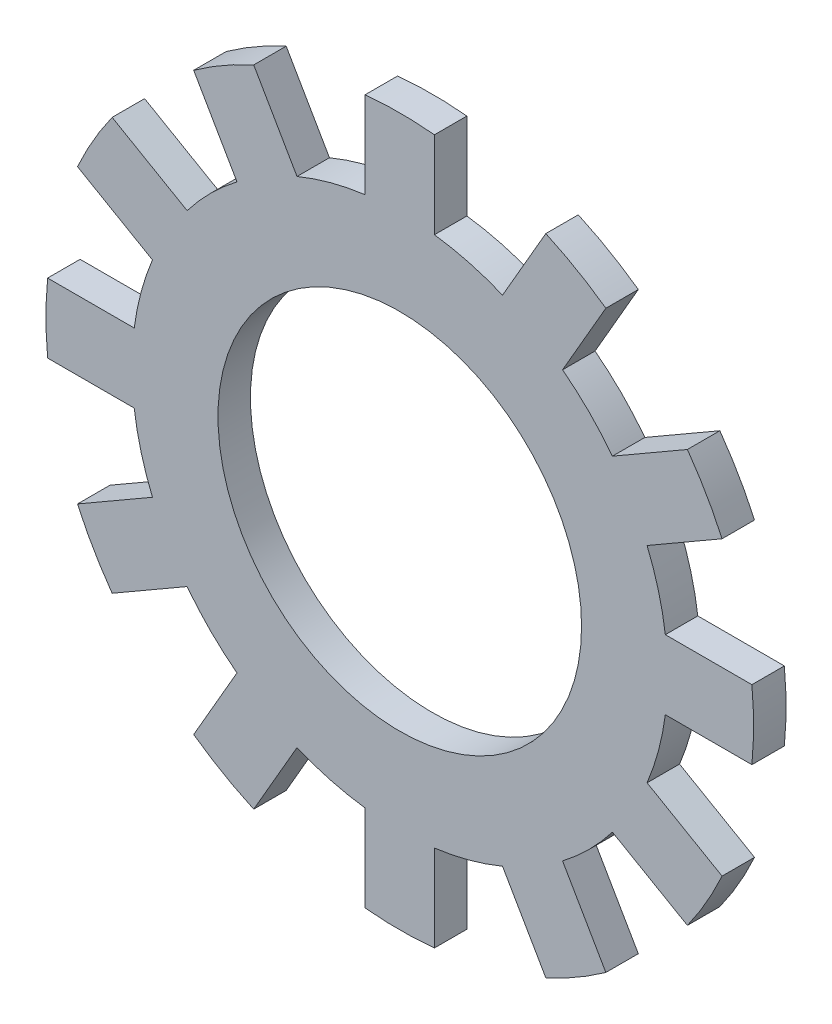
from build123d import *

# Parameters (mm, degrees)
SKETCH1_R         = 2.0625
SKETCH1_R_2       = 1.4
EXTRUDE1_DEPTH    = 0.25
EXTRUDE2_DEPTH    = 0.25
CIRPATTERN1_COUNT = 12


with BuildPart() as part:
    # Sketch1 → Extrude1 (new body)
    with BuildSketch(Plane.XY):
        Circle(SKETCH1_R)
        Circle(SKETCH1_R_2, mode=Mode.SUBTRACT)
    extrude(amount=EXTRUDE1_DEPTH)

    # Sketch2 → Extrude2 (add)
    with BuildSketch(Plane.XY):
        with BuildLine():
            Line((-0.26690714, 2.711897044), (-0.26690714, 2.04515692))
            Line((-0.26690714, 2.04515692), (0.26690714, 2.04515692))
            Line((0.26690714, 2.04515692), (0.26690714, 2.711897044))
            ThreePointArc((0.26690714, 2.711897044), (0, 2.725), (-0.26690714, 2.711897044))
        make_face()
    extrude2 = extrude(amount=EXTRUDE2_DEPTH)

    # CirPattern1: Extrude2 ×12 about axis
    cirpattern1_axis = Axis((0, 0, 0), (0, 0, 1))
    for i in range(1, CIRPATTERN1_COUNT):
        add(extrude2.rotate(cirpattern1_axis, i * 360 / CIRPATTERN1_COUNT))


solid = part.part
